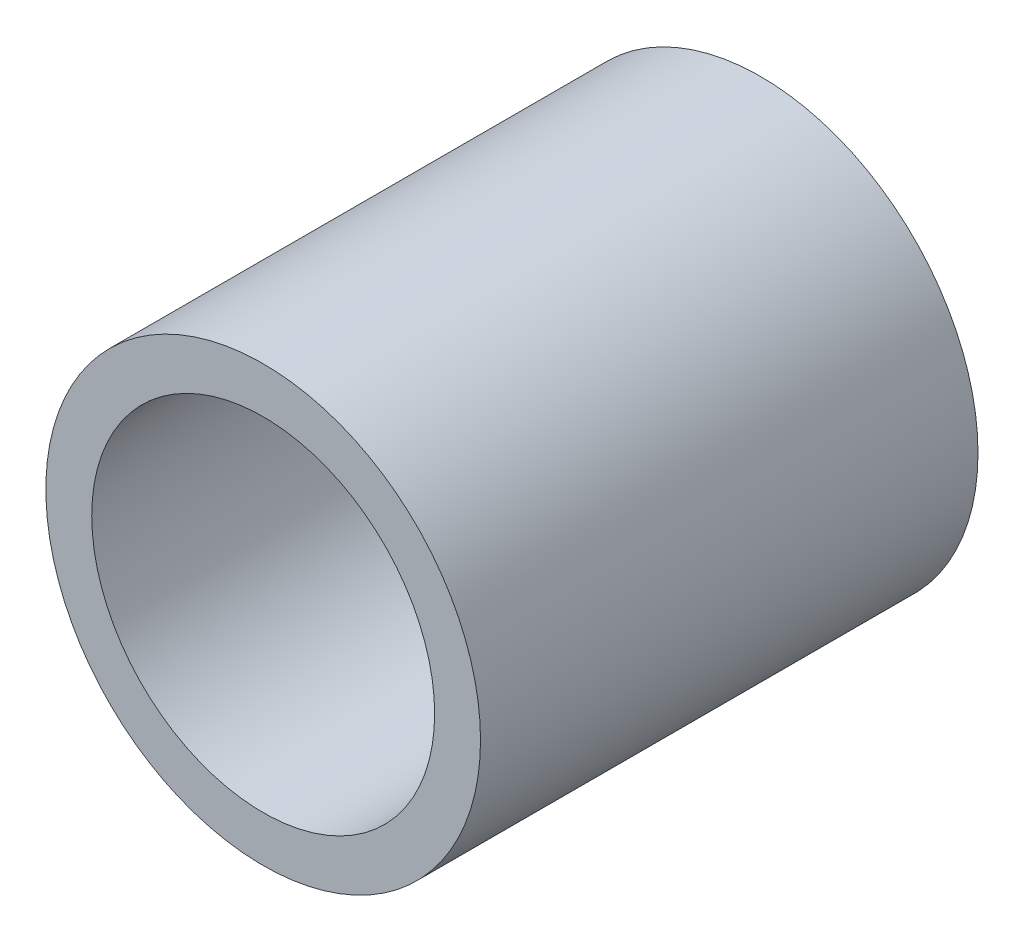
from build123d import *

# Parameters (mm, degrees)
SKICA1_R                 = 22.5
P_IDAT_VYSUNUT_M1_DEPTH  = 51.5
SKICA2_R                 = 17.75
ODEBRAT_VYSUNUT_M1_DEPTH = 51.5


with BuildPart() as part:
    # Skica1 → P_idat vysunut_m1 (new body)
    with BuildSketch(Plane.XY):
        Circle(SKICA1_R)
    extrude(amount=P_IDAT_VYSUNUT_M1_DEPTH)

    # Skica2 → Odebrat vysunut_m1 (cut)
    with BuildSketch(Plane.XY.offset(51.5)):
        Circle(SKICA2_R)
    extrude(amount=-ODEBRAT_VYSUNUT_M1_DEPTH, mode=Mode.SUBTRACT)


solid = part.part
